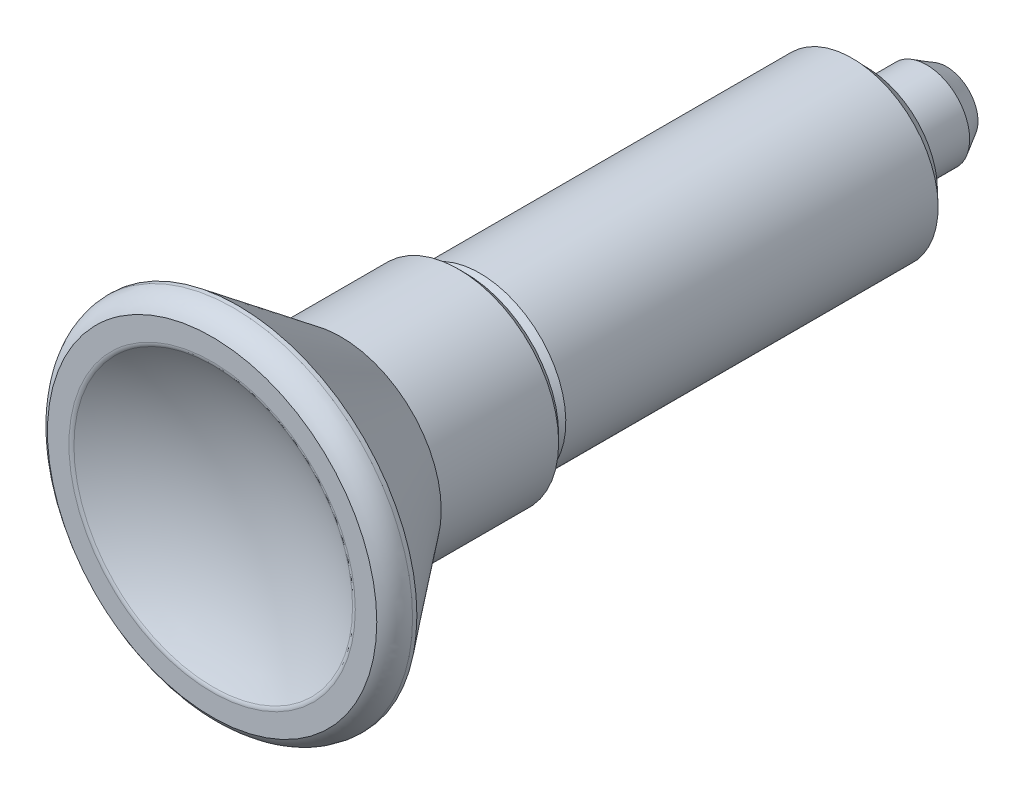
ISO-10303-21;
HEADER;
FILE_DESCRIPTION(('STEP AP214'),'2;1');
FILE_NAME('part.step','',(''),(''),'','','');
FILE_SCHEMA(('AUTOMOTIVE_DESIGN { 1 0 10303 214 1 1 1 1 }'));
ENDSEC;
DATA;
#1=APPLICATION_CONTEXT('core data for automotive mechanical design processes');
#2=APPLICATION_PROTOCOL_DEFINITION('international standard','automotive_design',2000,#1);
#3=PRODUCT_CONTEXT('',#1,'mechanical');
#4=PRODUCT('Part','Part','',(#3));
#5=PRODUCT_RELATED_PRODUCT_CATEGORY('part','',(#4));
#6=PRODUCT_DEFINITION_FORMATION('','',#4);
#7=PRODUCT_DEFINITION_CONTEXT('part definition',#1,'design');
#8=PRODUCT_DEFINITION('design','',#6,#7);
#9=PRODUCT_DEFINITION_SHAPE('','',#8);
#10=(LENGTH_UNIT() NAMED_UNIT(*) SI_UNIT(.MILLI.,.METRE.));
#11=(NAMED_UNIT(*) PLANE_ANGLE_UNIT() SI_UNIT($,.RADIAN.));
#12=(NAMED_UNIT(*) SI_UNIT($,.STERADIAN.) SOLID_ANGLE_UNIT());
#13=UNCERTAINTY_MEASURE_WITH_UNIT(LENGTH_MEASURE(1.E-05),#10,'distance_accuracy_value','');
#14=(GEOMETRIC_REPRESENTATION_CONTEXT(3) GLOBAL_UNCERTAINTY_ASSIGNED_CONTEXT((#13)) GLOBAL_UNIT_ASSIGNED_CONTEXT((#10,
#11,#12)) REPRESENTATION_CONTEXT('',''));
#15=CARTESIAN_POINT('',(0.,0.,0.));
#16=DIRECTION('',(0.,0.,1.));
#17=DIRECTION('',(1.,0.,0.));
#18=AXIS2_PLACEMENT_3D('',#15,#16,#17);
#19=CARTESIAN_POINT('',(0.,0.,2.4980018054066E-13));
#20=DIRECTION('',(0.,0.,1.));
#21=DIRECTION('',(-0.383049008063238,0.923728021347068,0.));
#22=AXIS2_PLACEMENT_3D('',#19,#20,#21);
#23=SPHERICAL_SURFACE('',#22,5.9999999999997);
#24=CARTESIAN_POINT('',(0.,0.,-5.58107460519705));
#25=DIRECTION('',(0.,0.,1.));
#26=DIRECTION('',(0.923728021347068,0.383049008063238,0.));
#27=AXIS2_PLACEMENT_3D('',#24,#25,#26);
#28=CIRCLE('',#27,2.20263620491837);
#29=CARTESIAN_POINT('',(2.03463678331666,0.843717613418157,-5.58107460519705));
#30=VERTEX_POINT('',#29);
#31=EDGE_CURVE('E37',#30,#30,#28,.T.);
#32=ORIENTED_EDGE('',*,*,#31,.F.);
#33=EDGE_LOOP('',(#32));
#34=FACE_BOUND('',#33,.T.);
#35=ADVANCED_FACE('F12',(#34),#23,.T.);
#36=CARTESIAN_POINT('',(0.,0.,-4.19999999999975));
#37=DIRECTION('',(0.,0.,1.));
#38=DIRECTION('',(0.923728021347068,0.383049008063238,0.));
#39=AXIS2_PLACEMENT_3D('',#36,#37,#38);
#40=CONICAL_SURFACE('',#39,3.,0.523598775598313);
#41=ORIENTED_EDGE('',*,*,#31,.T.);
#42=EDGE_LOOP('',(#41));
#43=FACE_BOUND('',#42,.T.);
#44=CARTESIAN_POINT('',(0.,0.,-4.19999999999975));
#45=DIRECTION('',(0.,0.,1.));
#46=DIRECTION('',(0.923728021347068,0.383049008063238,0.));
#47=AXIS2_PLACEMENT_3D('',#44,#45,#46);
#48=CIRCLE('',#47,3.);
#49=CARTESIAN_POINT('',(2.7711840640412,1.14914702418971,-4.19999999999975));
#50=VERTEX_POINT('',#49);
#51=EDGE_CURVE('E34',#50,#50,#48,.T.);
#52=ORIENTED_EDGE('',*,*,#51,.F.);
#53=EDGE_LOOP('',(#52));
#54=FACE_BOUND('',#53,.T.);
#55=ADVANCED_FACE('F134',(#43,#54),#40,.T.);
#56=CARTESIAN_POINT('',(0.,0.,36.0000000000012));
#57=DIRECTION('',(0.,0.,1.));
#58=DIRECTION('',(0.923728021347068,0.383049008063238,0.));
#59=AXIS2_PLACEMENT_3D('',#56,#57,#58);
#60=CYLINDRICAL_SURFACE('',#59,3.);
#61=ORIENTED_EDGE('',*,*,#51,.T.);
#62=EDGE_LOOP('',(#61));
#63=FACE_BOUND('',#62,.T.);
#64=CARTESIAN_POINT('',(0.,0.,0.));
#65=DIRECTION('',(0.,0.,1.));
#66=DIRECTION('',(0.923728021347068,0.383049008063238,0.));
#67=AXIS2_PLACEMENT_3D('',#64,#65,#66);
#68=CIRCLE('',#67,3.);
#69=CARTESIAN_POINT('',(2.7711840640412,1.14914702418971,0.));
#70=VERTEX_POINT('',#69);
#71=EDGE_CURVE('E31',#70,#70,#68,.T.);
#72=ORIENTED_EDGE('',*,*,#71,.F.);
#73=EDGE_LOOP('',(#72));
#74=FACE_BOUND('',#73,.T.);
#75=ADVANCED_FACE('F137',(#63,#74),#60,.T.);
#76=CARTESIAN_POINT('',(-1.89609258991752,4.57245370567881,0.));
#77=DIRECTION('',(0.,0.,-1.));
#78=DIRECTION('',(-0.923728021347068,-0.383049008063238,0.));
#79=AXIS2_PLACEMENT_3D('',#76,#77,#78);
#80=PLANE('',#79);
#81=ORIENTED_EDGE('',*,*,#71,.T.);
#82=EDGE_LOOP('',(#81));
#83=FACE_BOUND('',#82,.T.);
#84=CARTESIAN_POINT('',(0.,0.,0.));
#85=DIRECTION('',(0.,0.,1.));
#86=DIRECTION('',(0.923728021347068,0.383049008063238,0.));
#87=AXIS2_PLACEMENT_3D('',#84,#85,#86);
#88=CIRCLE('',#87,4.95000000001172);
#89=CARTESIAN_POINT('',(4.57245370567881,1.89609258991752,0.));
#90=VERTEX_POINT('',#89);
#91=EDGE_CURVE('E26',#90,#90,#88,.T.);
#92=ORIENTED_EDGE('',*,*,#91,.F.);
#93=EDGE_LOOP('',(#92));
#94=FACE_BOUND('',#93,.T.);
#95=ADVANCED_FACE('F141',(#83,#94),#80,.T.);
#96=CARTESIAN_POINT('',(0.,0.,0.999999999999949));
#97=DIRECTION('',(0.,0.,1.));
#98=DIRECTION('',(0.923728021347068,0.383049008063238,0.));
#99=AXIS2_PLACEMENT_3D('',#96,#97,#98);
#100=CONICAL_SURFACE('',#99,6.00000000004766,0.809783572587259);
#101=ORIENTED_EDGE('',*,*,#91,.T.);
#102=EDGE_LOOP('',(#101));
#103=FACE_BOUND('',#102,.T.);
#104=CARTESIAN_POINT('',(0.,0.,0.999999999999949));
#105=DIRECTION('',(0.,0.,1.));
#106=DIRECTION('',(0.923728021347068,0.383049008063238,0.));
#107=AXIS2_PLACEMENT_3D('',#104,#105,#106);
#108=CIRCLE('',#107,6.00000000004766);
#109=CARTESIAN_POINT('',(5.54236812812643,2.29829404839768,0.99999999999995));
#110=VERTEX_POINT('',#109);
#111=EDGE_CURVE('E22',#110,#110,#108,.T.);
#112=ORIENTED_EDGE('',*,*,#111,.F.);
#113=EDGE_LOOP('',(#112));
#114=FACE_BOUND('',#113,.T.);
#115=ADVANCED_FACE('F145',(#103,#114),#100,.T.);
#116=CARTESIAN_POINT('',(0.,0.,36.0000000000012));
#117=DIRECTION('',(0.,0.,1.));
#118=DIRECTION('',(0.923728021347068,0.383049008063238,0.));
#119=AXIS2_PLACEMENT_3D('',#116,#117,#118);
#120=CYLINDRICAL_SURFACE('',#119,6.00000000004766);
#121=ORIENTED_EDGE('',*,*,#111,.T.);
#122=EDGE_LOOP('',(#121));
#123=FACE_BOUND('',#122,.T.);
#124=CARTESIAN_POINT('',(0.,0.,27.));
#125=DIRECTION('',(0.,0.,1.));
#126=DIRECTION('',(0.923728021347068,0.383049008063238,0.));
#127=AXIS2_PLACEMENT_3D('',#124,#125,#126);
#128=CIRCLE('',#127,6.00000000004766);
#129=CARTESIAN_POINT('',(5.54236812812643,2.29829404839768,27.));
#130=VERTEX_POINT('',#129);
#131=EDGE_CURVE('E18',#130,#130,#128,.T.);
#132=ORIENTED_EDGE('',*,*,#131,.F.);
#133=EDGE_LOOP('',(#132));
#134=FACE_BOUND('',#133,.T.);
#135=ADVANCED_FACE('F149',(#123,#134),#120,.T.);
#136=CARTESIAN_POINT('',(0.,0.,28.000000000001));
#137=DIRECTION('',(0.,0.,-1.));
#138=DIRECTION('',(-0.923728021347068,-0.383049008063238,0.));
#139=AXIS2_PLACEMENT_3D('',#136,#137,#138);
#140=CONICAL_SURFACE('',#139,5.00000000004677,0.785398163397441);
#141=ORIENTED_EDGE('',*,*,#131,.T.);
#142=EDGE_LOOP('',(#141));
#143=FACE_BOUND('',#142,.T.);
#144=CARTESIAN_POINT('',(0.,0.,28.000000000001));
#145=DIRECTION('',(0.,0.,1.));
#146=DIRECTION('',(0.923728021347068,0.383049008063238,0.));
#147=AXIS2_PLACEMENT_3D('',#144,#145,#146);
#148=CIRCLE('',#147,5.00000000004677);
#149=CARTESIAN_POINT('',(4.61864010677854,1.91524504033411,28.000000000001));
#150=VERTEX_POINT('',#149);
#151=EDGE_CURVE('E8',#150,#150,#148,.T.);
#152=ORIENTED_EDGE('',*,*,#151,.F.);
#153=EDGE_LOOP('',(#152));
#154=FACE_BOUND('',#153,.T.);
#155=ADVANCED_FACE('F132',(#143,#154),#140,.T.);
#156=CARTESIAN_POINT('',(-4.22152478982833E-13,0.,60.7643824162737));
#157=DIRECTION('',(0.,0.,-1.));
#158=DIRECTION('',(1.,0.,0.));
#159=AXIS2_PLACEMENT_3D('',#156,#157,#158);
#160=SPHERICAL_SURFACE('',#159,17.9999999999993);
#161=CARTESIAN_POINT('',(0.,0.,45.6206589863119));
#162=DIRECTION('',(0.,0.,-1.));
#163=DIRECTION('',(1.,0.,0.));
#164=AXIS2_PLACEMENT_3D('',#161,#162,#163);
#165=CIRCLE('',#164,9.72972973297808);
#166=CARTESIAN_POINT('',(9.72972973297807,0.,45.6206589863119));
#167=VERTEX_POINT('',#166);
#168=EDGE_CURVE('E41',#167,#167,#165,.T.);
#169=ORIENTED_EDGE('',*,*,#168,.F.);
#170=EDGE_LOOP('',(#169));
#171=FACE_BOUND('',#170,.T.);
#172=ADVANCED_FACE('F123',(#171),#160,.F.);
#173=CARTESIAN_POINT('',(9.72972973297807,0.,45.6206589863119));
#174=CARTESIAN_POINT('',(9.85321912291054,0.,45.7000000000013));
#175=CARTESIAN_POINT('',(10.,0.,45.7000000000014));
#176=CARTESIAN_POINT('',(9.72972973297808,-16.8523862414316,45.620658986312));
#177=CARTESIAN_POINT('',(9.85321912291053,-17.0662761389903,45.7000000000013));
#178=CARTESIAN_POINT('',(10.,-17.3205080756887,45.7000000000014));
#179=CARTESIAN_POINT('',(-4.86486486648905,-8.4261931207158,45.6206589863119));
#180=CARTESIAN_POINT('',(-4.92660956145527,-8.53313806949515,45.7000000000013));
#181=CARTESIAN_POINT('',(-5.,-8.66025403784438,45.7000000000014));
#182=CARTESIAN_POINT('',(-19.4594594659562,0.,45.620658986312));
#183=CARTESIAN_POINT('',(-19.7064382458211,0.,45.7000000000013));
#184=CARTESIAN_POINT('',(-20.,0.,45.7000000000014));
#185=CARTESIAN_POINT('',(-4.86486486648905,8.4261931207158,45.6206589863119));
#186=CARTESIAN_POINT('',(-4.92660956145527,8.53313806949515,45.7000000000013));
#187=CARTESIAN_POINT('',(-5.,8.66025403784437,45.7000000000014));
#188=CARTESIAN_POINT('',(9.72972973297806,16.8523862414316,45.620658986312));
#189=CARTESIAN_POINT('',(9.85321912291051,17.0662761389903,45.7000000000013));
#190=CARTESIAN_POINT('',(10.,17.3205080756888,45.7000000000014));
#191=CARTESIAN_POINT('',(9.72972973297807,0.,45.6206589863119));
#192=CARTESIAN_POINT('',(9.85321912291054,0.,45.7000000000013));
#193=CARTESIAN_POINT('',(10.,0.,45.7000000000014));
#194=(BOUNDED_SURFACE() B_SPLINE_SURFACE(2,2,((#173,#174,#175),(#176,#177,#178),(#179,#180,
#181),(#182,#183,#184),(#185,#186,#187),(#188,#189,#190),(#191,#192,#193)),.UNSPECIFIED.,.T.,
.F.,.F.) B_SPLINE_SURFACE_WITH_KNOTS((3,2,2,3),(3,3),(0.,116.340564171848,232.681128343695,
349.021692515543),(0.,1.),
.UNSPECIFIED.) GEOMETRIC_REPRESENTATION_ITEM() RATIONAL_B_SPLINE_SURFACE(((1.,0.959509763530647,
1.),(0.5,0.479754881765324,0.5),(1.,0.959509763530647,1.),(0.5,0.479754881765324,0.5),(1.,
0.959509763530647,1.),(0.5,0.479754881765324,0.5),(1.,0.959509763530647,1.))) REPRESENTATION_ITEM('') SURFACE());
#195=CARTESIAN_POINT('',(0.,0.,45.7000000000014));
#196=DIRECTION('',(0.,0.,-1.));
#197=DIRECTION('',(1.,0.,0.));
#198=AXIS2_PLACEMENT_3D('',#195,#196,#197);
#199=CIRCLE('',#198,10.);
#200=CARTESIAN_POINT('',(10.,0.,45.7000000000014));
#201=VERTEX_POINT('',#200);
#202=EDGE_CURVE('E45',#201,#201,#199,.T.);
#203=CARTESIAN_POINT('',(9.72972973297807,0.,45.6206589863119));
#204=CARTESIAN_POINT('',(9.73220132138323,0.,45.6222469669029));
#205=CARTESIAN_POINT('',(9.73468690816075,0.,45.6238131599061));
#206=CARTESIAN_POINT('',(9.7396912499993,0.,45.6269051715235));
#207=CARTESIAN_POINT('',(9.7422100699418,0.,45.6284308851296));
#208=CARTESIAN_POINT('',(9.74727991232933,0.,45.631440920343));
#209=CARTESIAN_POINT('',(9.74983099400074,0.,45.6329251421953));
#210=CARTESIAN_POINT('',(9.75496435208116,0.,45.6358512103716));
#211=CARTESIAN_POINT('',(9.75754668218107,0.,45.6372929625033));
#212=CARTESIAN_POINT('',(9.7627414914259,0.,45.6401331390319));
#213=CARTESIAN_POINT('',(9.76535401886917,0.,45.6415314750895));
#214=CARTESIAN_POINT('',(9.77060813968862,0.,45.6442839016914));
#215=CARTESIAN_POINT('',(9.77324977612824,0.,45.6456379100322));
#216=CARTESIAN_POINT('',(9.77856099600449,0.,45.6483007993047));
#217=CARTESIAN_POINT('',(9.78123061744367,0.,45.6496096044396));
#218=CARTESIAN_POINT('',(9.78659665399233,0.,45.6521812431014));
#219=CARTESIAN_POINT('',(9.78929310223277,0.,45.6534440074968));
#220=CARTESIAN_POINT('',(9.79471160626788,0.,45.6559227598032));
#221=CARTESIAN_POINT('',(9.79743369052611,0.,45.6571386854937));
#222=CARTESIAN_POINT('',(9.80290224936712,0.,45.6595229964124));
#223=CARTESIAN_POINT('',(9.80564874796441,0.,45.6606913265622));
#224=CARTESIAN_POINT('',(9.81116488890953,0.,45.6629797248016));
#225=CARTESIAN_POINT('',(9.81393455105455,0.,45.6640997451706));
#226=CARTESIAN_POINT('',(9.81949574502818,0.,45.6662908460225));
#227=CARTESIAN_POINT('',(9.82228729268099,0.,45.6673618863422));
#228=CARTESIAN_POINT('',(9.82789095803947,0.,45.6694543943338));
#229=CARTESIAN_POINT('',(9.83070308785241,0.,45.6704758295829));
#230=CARTESIAN_POINT('',(9.83634659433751,0.,45.6724685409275));
#231=CARTESIAN_POINT('',(9.83917797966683,0.,45.6734397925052));
#232=CARTESIAN_POINT('',(9.84485865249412,0.,45.6753315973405));
#233=CARTESIAN_POINT('',(9.84770794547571,0.,45.6762521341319));
#234=CARTESIAN_POINT('',(9.85342306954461,0.,45.6780420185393));
#235=CARTESIAN_POINT('',(9.85628890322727,0.,45.6789113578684));
#236=CARTESIAN_POINT('',(9.86203572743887,0.,45.6805984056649));
#237=CARTESIAN_POINT('',(9.86491671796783,0.,45.6814161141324));
#238=CARTESIAN_POINT('',(9.87069245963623,0.,45.6829995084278));
#239=CARTESIAN_POINT('',(9.87358720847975,0.,45.6837652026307));
#240=CARTESIAN_POINT('',(9.87938905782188,0.,45.6852442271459));
#241=CARTESIAN_POINT('',(9.88229615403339,0.,45.6859575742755));
#242=CARTESIAN_POINT('',(9.88812127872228,0.,45.6873316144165));
#243=CARTESIAN_POINT('',(9.89103930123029,0.,45.6879923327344));
#244=CARTESIAN_POINT('',(9.89688485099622,0.,45.6892608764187));
#245=CARTESIAN_POINT('',(9.89981237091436,0.,45.6898687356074));
#246=CARTESIAN_POINT('',(9.90567548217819,0.,45.6910313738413));
#247=CARTESIAN_POINT('',(9.90861106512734,0.,45.6915861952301));
#248=CARTESIAN_POINT('',(9.91448886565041,0.,45.6926426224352));
#249=CARTESIAN_POINT('',(9.91743107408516,0.,45.6931442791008));
#250=CARTESIAN_POINT('',(9.92332068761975,0.,45.6940942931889));
#251=CARTESIAN_POINT('',(9.92626808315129,0.,45.6945427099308));
#252=CARTESIAN_POINT('',(9.93216663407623,0.,45.6953862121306));
#253=CARTESIAN_POINT('',(9.93511777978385,0.,45.6957813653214));
#254=CARTESIAN_POINT('',(9.94102239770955,0.,45.6965183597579));
#255=CARTESIAN_POINT('',(9.94397586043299,0.,45.6968602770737));
#256=CARTESIAN_POINT('',(9.94988368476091,0.,45.697490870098));
#257=CARTESIAN_POINT('',(9.95283803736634,0.,45.6977796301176));
#258=CARTESIAN_POINT('',(9.95874622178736,0.,45.6983040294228));
#259=CARTESIAN_POINT('',(9.96170004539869,0.,45.6985397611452));
#260=CARTESIAN_POINT('',(9.96760576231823,0.,45.6989582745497));
#261=CARTESIAN_POINT('',(9.97055764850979,0.,45.6991411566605));
#262=CARTESIAN_POINT('',(9.97645809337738,0.,45.6994541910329));
#263=CARTESIAN_POINT('',(9.97940664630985,0.,45.6995844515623));
#264=CARTESIAN_POINT('',(9.98529904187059,0.,45.6997925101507));
#265=CARTESIAN_POINT('',(9.98824288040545,0.,45.6998704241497));
#266=CARTESIAN_POINT('',(9.99412448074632,0.,45.6999741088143));
#267=CARTESIAN_POINT('',(9.99706224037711,0.,45.7000000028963));
#268=CARTESIAN_POINT('',(10.,0.,45.7000000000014));
#269=B_SPLINE_CURVE_WITH_KNOTS('',3,(#203,#204,#205,#206,#207,#208,#209,#210,#211,#212,#213,
#214,#215,#216,#217,#218,#219,#220,#221,#222,#223,#224,#225,#226,#227,#228,#229,#230,#231,#232,
#233,#234,#235,#236,#237,#238,#239,#240,#241,#242,#243,#244,#245,#246,#247,#248,#249,#250,#251,
#252,#253,#254,#255,#256,#257,#258,#259,#260,#261,#262,#263,#264,#265,#266,#267,#268),
.UNSPECIFIED.,.F.,.F.,(4,2,2,2,2,2,2,2,2,2,2,2,2,2,2,2,2,2,2,2,2,2,2,2,2,2,2,2,2,2,2,2,4),(0.,
0.00881316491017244,0.0176473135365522,0.026501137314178,0.0353733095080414,0.0442624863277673,
0.0531673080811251,0.0620864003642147,0.0710183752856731,0.0799618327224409,0.0889153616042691,
0.0978775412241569,0.106846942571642,0.115822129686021,0.124801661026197,0.133784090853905,
0.142767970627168,0.151751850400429,0.160734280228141,0.169713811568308,0.178688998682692,
0.187658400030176,0.196620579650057,0.20557410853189,0.214517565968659,0.223449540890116,
0.232368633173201,0.241273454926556,0.250162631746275,0.259034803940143,0.267888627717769,
0.276722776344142,0.285535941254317),.UNSPECIFIED.);
#270=EDGE_CURVE('BSEAM117',#167,#201,#269,.T.);
#271=ORIENTED_EDGE('',*,*,#168,.T.);
#272=ORIENTED_EDGE('',*,*,#202,.F.);
#273=ORIENTED_EDGE('',*,*,#270,.T.);
#274=ORIENTED_EDGE('',*,*,#270,.F.);
#275=EDGE_LOOP('',(#271,#273,#272,#274));
#276=FACE_BOUND('',#275,.T.);
#277=ADVANCED_FACE('F117',(#276),#194,.T.);
#278=CARTESIAN_POINT('',(-12.65,-12.65,45.7000000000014));
#279=DIRECTION('',(0.,0.,1.));
#280=DIRECTION('',(1.,0.,0.));
#281=AXIS2_PLACEMENT_3D('',#278,#279,#280);
#282=PLANE('',#281);
#283=CARTESIAN_POINT('',(0.,0.,45.7000000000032));
#284=DIRECTION('',(0.,0.,-1.));
#285=DIRECTION('',(1.,0.,0.));
#286=AXIS2_PLACEMENT_3D('',#283,#284,#285);
#287=CIRCLE('',#286,11.4999999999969);
#288=CARTESIAN_POINT('',(11.4999999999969,0.,45.7000000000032));
#289=VERTEX_POINT('',#288);
#290=EDGE_CURVE('E49',#289,#289,#287,.T.);
#291=ORIENTED_EDGE('',*,*,#290,.F.);
#292=EDGE_LOOP('',(#291));
#293=FACE_BOUND('',#292,.T.);
#294=ORIENTED_EDGE('',*,*,#202,.T.);
#295=EDGE_LOOP('',(#294));
#296=FACE_BOUND('',#295,.T.);
#297=ADVANCED_FACE('F108',(#293,#296),#282,.T.);
#298=CARTESIAN_POINT('',(11.4999999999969,0.,45.7000000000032));
#299=CARTESIAN_POINT('',(12.3786586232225,0.,45.2024390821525));
#300=CARTESIAN_POINT('',(12.5,0.,44.200000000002));
#301=CARTESIAN_POINT('',(11.4999999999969,-19.9185842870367,45.7000000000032));
#302=CARTESIAN_POINT('',(12.3786586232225,-21.440465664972,45.2024390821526));
#303=CARTESIAN_POINT('',(12.5,-21.6506350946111,44.200000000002));
#304=CARTESIAN_POINT('',(-5.74999999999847,-9.95929214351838,45.7000000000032));
#305=CARTESIAN_POINT('',(-6.18932931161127,-10.720232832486,45.2024390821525));
#306=CARTESIAN_POINT('',(-6.25,-10.8253175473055,44.200000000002));
#307=CARTESIAN_POINT('',(-22.9999999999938,0.,45.7000000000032));
#308=CARTESIAN_POINT('',(-24.7573172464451,0.,45.2024390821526));
#309=CARTESIAN_POINT('',(-25.,0.,44.200000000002));
#310=CARTESIAN_POINT('',(-5.74999999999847,9.95929214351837,45.7000000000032));
#311=CARTESIAN_POINT('',(-6.18932931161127,10.720232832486,45.2024390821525));
#312=CARTESIAN_POINT('',(-6.25,10.8253175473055,44.200000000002));
#313=CARTESIAN_POINT('',(11.4999999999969,19.9185842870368,45.7000000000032));
#314=CARTESIAN_POINT('',(12.3786586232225,21.440465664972,45.2024390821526));
#315=CARTESIAN_POINT('',(12.5,21.6506350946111,44.200000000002));
#316=CARTESIAN_POINT('',(11.4999999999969,0.,45.7000000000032));
#317=CARTESIAN_POINT('',(12.3786586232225,0.,45.2024390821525));
#318=CARTESIAN_POINT('',(12.5,0.,44.200000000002));
#319=(BOUNDED_SURFACE() B_SPLINE_SURFACE(2,2,((#298,#299,#300),(#301,#302,#303),(#304,#305,
#306),(#307,#308,#309),(#310,#311,#312),(#313,#314,#315),(#316,#317,#318)),.UNSPECIFIED.,.T.,
.F.,.F.) B_SPLINE_SURFACE_WITH_KNOTS((3,2,2,3),(3,3),(0.,20.8901320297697,41.7802640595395,
62.6703960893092),(0.,1.),
.UNSPECIFIED.) GEOMETRIC_REPRESENTATION_ITEM() RATIONAL_B_SPLINE_SURFACE(((1.,0.89267855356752,
1.),(0.5,0.44633927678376,0.5),(1.,0.89267855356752,1.),(0.5,0.44633927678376,0.5),(1.,
0.89267855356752,1.),(0.5,0.44633927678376,0.5),(1.,0.89267855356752,1.))) REPRESENTATION_ITEM('') SURFACE());
#320=CARTESIAN_POINT('',(0.,0.,44.200000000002));
#321=DIRECTION('',(0.,0.,-1.));
#322=DIRECTION('',(1.,0.,0.));
#323=AXIS2_PLACEMENT_3D('',#320,#321,#322);
#324=CIRCLE('',#323,12.5);
#325=CARTESIAN_POINT('',(12.5,0.,44.200000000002));
#326=VERTEX_POINT('',#325);
#327=EDGE_CURVE('E53',#326,#326,#324,.T.);
#328=CARTESIAN_POINT('',(11.4999999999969,0.,45.7000000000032));
#329=CARTESIAN_POINT('',(11.5040886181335,0.,45.6976847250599));
#330=CARTESIAN_POINT('',(11.5081690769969,0.,45.6953550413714));
#331=CARTESIAN_POINT('',(11.516320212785,0.,45.6906630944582));
#332=CARTESIAN_POINT('',(11.5203908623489,0.,45.6883007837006));
#333=CARTESIAN_POINT('',(11.5285220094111,0.,45.6835436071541));
#334=CARTESIAN_POINT('',(11.5325824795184,0.,45.6811486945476));
#335=CARTESIAN_POINT('',(11.5406928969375,0.,45.6763263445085));
#336=CARTESIAN_POINT('',(11.5447428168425,0.,45.673898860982));
#337=CARTESIAN_POINT('',(11.5528317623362,0.,45.6690114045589));
#338=CARTESIAN_POINT('',(11.5568707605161,0.,45.6665513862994));
#339=CARTESIAN_POINT('',(11.5649374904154,0.,45.6615989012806));
#340=CARTESIAN_POINT('',(11.5689651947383,0.,45.6591063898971));
#341=CARTESIAN_POINT('',(11.577008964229,0.,45.6540889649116));
#342=CARTESIAN_POINT('',(11.581025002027,0.,45.6515640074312));
#343=CARTESIAN_POINT('',(11.5890450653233,0.,45.6464817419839));
#344=CARTESIAN_POINT('',(11.5930490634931,0.,45.6439243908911));
#345=CARTESIAN_POINT('',(11.6010446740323,0.,45.638777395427));
#346=CARTESIAN_POINT('',(11.605036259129,0.,45.6361877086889));
#347=CARTESIAN_POINT('',(11.6130066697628,0.,45.630976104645));
#348=CARTESIAN_POINT('',(11.6169854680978,0.,45.6283541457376));
#349=CARTESIAN_POINT('',(11.6249299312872,0.,45.6230780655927));
#350=CARTESIAN_POINT('',(11.6288955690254,0.,45.6204239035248));
#351=CARTESIAN_POINT('',(11.6368133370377,0.,45.6150834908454));
#352=CARTESIAN_POINT('',(11.6407654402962,0.,45.6123972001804));
#353=CARTESIAN_POINT('',(11.6486557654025,0.,45.6069926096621));
#354=CARTESIAN_POINT('',(11.6525939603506,0.,45.6042742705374));
#355=CARTESIAN_POINT('',(11.6604560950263,0.,45.5988056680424));
#356=CARTESIAN_POINT('',(11.6643800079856,0.,45.5960553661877));
#357=CARTESIAN_POINT('',(11.6722132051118,0.,45.5905229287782));
#358=CARTESIAN_POINT('',(11.6761224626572,0.,45.5877407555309));
#359=CARTESIAN_POINT('',(11.6839259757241,0.,45.5821446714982));
#360=CARTESIAN_POINT('',(11.6878202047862,0.,45.5793307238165));
#361=CARTESIAN_POINT('',(11.6955932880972,0.,45.5736711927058));
#362=CARTESIAN_POINT('',(11.6994721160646,0.,45.5708255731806));
#363=CARTESIAN_POINT('',(11.7072140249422,0.,45.5651028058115));
#364=CARTESIAN_POINT('',(11.7110770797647,0.,45.5622256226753));
#365=CARTESIAN_POINT('',(11.718787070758,0.,45.5564398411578));
#366=CARTESIAN_POINT('',(11.7226339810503,0.,45.5535312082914));
#367=CARTESIAN_POINT('',(11.7303113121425,0.,45.5476826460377));
#368=CARTESIAN_POINT('',(11.734141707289,0.,45.5447426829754));
#369=CARTESIAN_POINT('',(11.7417856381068,0.,45.5388315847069));
#370=CARTESIAN_POINT('',(11.7455991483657,0.,45.5358604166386));
#371=CARTESIAN_POINT('',(11.7532089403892,0.,45.5298870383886));
#372=CARTESIAN_POINT('',(11.7570051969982,0.,45.5268847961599));
#373=CARTESIAN_POINT('',(11.7645801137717,0.,45.5208494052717));
#374=CARTESIAN_POINT('',(11.7683587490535,0.,45.5178162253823));
#375=CARTESIAN_POINT('',(11.7758980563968,0.,45.5117191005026));
#376=CARTESIAN_POINT('',(11.7796587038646,0.,45.5086551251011));
#377=CARTESIAN_POINT('',(11.7871616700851,0.,45.5024965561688));
#378=CARTESIAN_POINT('',(11.7909039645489,0.,45.4994019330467));
#379=CARTESIAN_POINT('',(11.7983698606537,0.,45.4931822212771));
#380=CARTESIAN_POINT('',(11.8020934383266,0.,45.4900571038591));
#381=CARTESIAN_POINT('',(11.8095215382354,0.,45.4837765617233));
#382=CARTESIAN_POINT('',(11.81322603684,0.,45.4806211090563));
#383=CARTESIAN_POINT('',(11.8206156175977,0.,45.4742800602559));
#384=CARTESIAN_POINT('',(11.8243006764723,0.,45.4710944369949));
#385=CARTESIAN_POINT('',(11.8316510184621,0.,45.4646932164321));
#386=CARTESIAN_POINT('',(11.8353162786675,0.,45.4614775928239));
#387=CARTESIAN_POINT('',(11.8426266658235,0.,45.4550165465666));
#388=CARTESIAN_POINT('',(11.8462717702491,0.,45.4517710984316));
#389=CARTESIAN_POINT('',(11.8535414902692,0.,45.445250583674));
#390=CARTESIAN_POINT('',(11.8571660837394,0.,45.4419754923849));
#391=CARTESIAN_POINT('',(11.8643944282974,0.,45.4353958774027));
#392=CARTESIAN_POINT('',(11.8679981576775,0.,45.4320913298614));
#393=CARTESIAN_POINT('',(11.8751844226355,0.,45.4254529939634));
#394=CARTESIAN_POINT('',(11.8787669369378,0.,45.4221191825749));
#395=CARTESIAN_POINT('',(11.8859104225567,0.,45.4154225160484));
#396=CARTESIAN_POINT('',(11.8894713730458,0.,45.4120596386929));
#397=CARTESIAN_POINT('',(11.896571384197,0.,45.4053050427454));
#398=CARTESIAN_POINT('',(11.9001104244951,0.,45.4019133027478));
#399=CARTESIAN_POINT('',(11.9071662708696,0.,45.3951011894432));
#400=CARTESIAN_POINT('',(11.9106830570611,0.,45.3916807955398));
#401=CARTESIAN_POINT('',(11.9176940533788,0.,45.3848115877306));
#402=CARTESIAN_POINT('',(11.9211882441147,0.,45.3813627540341));
#403=CARTESIAN_POINT('',(11.9281537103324,0.,45.3744368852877));
#404=CARTESIAN_POINT('',(11.9316249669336,0.,45.3709598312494));
#405=CARTESIAN_POINT('',(11.9385442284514,0.,45.3639777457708));
#406=CARTESIAN_POINT('',(11.9419922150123,0.,45.3604726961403));
#407=CARTESIAN_POINT('',(11.9488646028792,0.,45.3534348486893));
#408=CARTESIAN_POINT('',(11.9522889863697,0.,45.3499020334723));
#409=CARTESIAN_POINT('',(11.9591138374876,0.,45.3428088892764));
#410=CARTESIAN_POINT('',(11.9625142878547,0.,45.33924854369));
#411=CARTESIAN_POINT('',(11.9692909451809,0.,45.3321005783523));
#412=CARTESIAN_POINT('',(11.9726671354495,0.,45.3285129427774));
#413=CARTESIAN_POINT('',(11.9793949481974,0.,45.32131064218));
#414=CARTESIAN_POINT('',(11.9827465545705,0.,45.3176959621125));
#415=CARTESIAN_POINT('',(11.9894248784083,0.,45.3104398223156));
#416=CARTESIAN_POINT('',(11.9927515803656,0.,45.3067983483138));
#417=CARTESIAN_POINT('',(11.9993797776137,0.,45.2994888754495));
#418=CARTESIAN_POINT('',(12.0026812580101,0.,45.295820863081));
#419=CARTESIAN_POINT('',(12.0092586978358,0.,45.2884585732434));
#420=CARTESIAN_POINT('',(12.0125346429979,0.,45.284764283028));
#421=CARTESIAN_POINT('',(12.0190607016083,0.,45.2773497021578));
#422=CARTESIAN_POINT('',(12.0223108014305,0.,45.2736293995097));
#423=CARTESIAN_POINT('',(12.0287848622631,0.,45.2661630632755));
#424=CARTESIAN_POINT('',(12.0320088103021,0.,45.2624170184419));
#425=CARTESIAN_POINT('',(12.0384302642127,0.,45.2548994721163));
#426=CARTESIAN_POINT('',(12.041627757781,0.,45.2511279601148));
#427=CARTESIAN_POINT('',(12.0479960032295,0.,45.2435597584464));
#428=CARTESIAN_POINT('',(12.0511667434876,0.,45.239763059));
#429=CARTESIAN_POINT('',(12.0574811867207,0.,45.2321447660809));
#430=CARTESIAN_POINT('',(12.0606248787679,0.,45.2283231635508));
#431=CARTESIAN_POINT('',(12.0668849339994,0.,45.2206553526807));
#432=CARTESIAN_POINT('',(12.070001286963,0.,45.2168091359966));
#433=CARTESIAN_POINT('',(12.0762063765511,0.,45.2090923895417));
#434=CARTESIAN_POINT('',(12.0792951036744,0.,45.205221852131));
#435=CARTESIAN_POINT('',(12.0854446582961,0.,45.1974567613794));
#436=CARTESIAN_POINT('',(12.0885054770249,0.,45.1935622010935));
#437=CARTESIAN_POINT('',(12.094598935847,0.,45.1857493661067));
#438=CARTESIAN_POINT('',(12.0976315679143,0.,45.181831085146));
#439=CARTESIAN_POINT('',(12.1036683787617,0.,45.1739711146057));
#440=CARTESIAN_POINT('',(12.106672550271,0.,45.1700294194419));
#441=CARTESIAN_POINT('',(12.1126521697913,0.,45.1621229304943));
#442=CARTESIAN_POINT('',(12.1156276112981,0.,45.1581581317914));
#443=CARTESIAN_POINT('',(12.1215495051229,0.,45.1502057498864));
#444=CARTESIAN_POINT('',(12.1244959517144,0.,45.1462181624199));
#445=CARTESIAN_POINT('',(12.1303595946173,0.,45.1382205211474));
#446=CARTESIAN_POINT('',(12.1332767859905,0.,45.134210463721));
#447=CARTESIAN_POINT('',(12.1390816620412,0.,45.1261682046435));
#448=CARTESIAN_POINT('',(12.1419693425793,0.,45.1221360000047));
#449=CARTESIAN_POINT('',(12.1477149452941,0.,45.1140497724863));
#450=CARTESIAN_POINT('',(12.1505728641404,0.,45.1099957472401));
#451=CARTESIAN_POINT('',(12.1562586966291,0.,45.1018662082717));
#452=CARTESIAN_POINT('',(12.1590866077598,0.,45.0977906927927));
#453=CARTESIAN_POINT('',(12.1647121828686,0.,45.0896185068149));
#454=CARTESIAN_POINT('',(12.1675098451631,0.,45.0855218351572));
#455=CARTESIAN_POINT('',(12.1730746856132,0.,45.0773076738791));
#456=CARTESIAN_POINT('',(12.1758418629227,0.,45.0731901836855));
#457=CARTESIAN_POINT('',(12.1813455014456,0.,45.0649347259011));
#458=CARTESIAN_POINT('',(12.1840819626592,0.,45.0607967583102));
#459=CARTESIAN_POINT('',(12.1895239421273,0.,45.0525006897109));
#460=CARTESIAN_POINT('',(12.1922294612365,0.,45.048342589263));
#461=CARTESIAN_POINT('',(12.1976093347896,0.,45.0400066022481));
#462=CARTESIAN_POINT('',(12.2002836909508,0.,45.0358287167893));
#463=CARTESIAN_POINT('',(12.2056010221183,0.,45.0274535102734));
#464=CARTESIAN_POINT('',(12.2082439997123,0.,45.0232561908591));
#465=CARTESIAN_POINT('',(12.2134983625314,0.,45.0148424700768));
#466=CARTESIAN_POINT('',(12.2161097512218,0.,45.0106260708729));
#467=CARTESIAN_POINT('',(12.2213007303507,0.,45.0021745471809));
#468=CARTESIAN_POINT('',(12.2238803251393,0.,44.9979394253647));
#469=CARTESIAN_POINT('',(12.2290075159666,0.,44.9894508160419));
#470=CARTESIAN_POINT('',(12.2315551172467,0.,44.9851973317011));
#471=CARTESIAN_POINT('',(12.2366181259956,0.,44.9766723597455));
#472=CARTESIAN_POINT('',(12.2391335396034,0.,44.9724008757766));
#473=CARTESIAN_POINT('',(12.2441319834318,0.,44.9638402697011));
#474=CARTESIAN_POINT('',(12.2466150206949,0.,44.9595511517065));
#475=CARTESIAN_POINT('',(12.2515485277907,0.,44.9509556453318));
#476=CARTESIAN_POINT('',(12.2539990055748,0.,44.9466492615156));
#477=CARTESIAN_POINT('',(12.2588672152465,0.,44.9380195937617));
#478=CARTESIAN_POINT('',(12.2612849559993,0.,44.9336963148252));
#479=CARTESIAN_POINT('',(12.2660875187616,0.,44.9250332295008));
#480=CARTESIAN_POINT('',(12.2684723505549,0.,44.9206934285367));
#481=CARTESIAN_POINT('',(12.2732089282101,0.,44.9119976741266));
#482=CARTESIAN_POINT('',(12.2755606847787,0.,44.9076417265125));
#483=CARTESIAN_POINT('',(12.2802309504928,0.,44.8989140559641));
#484=CARTESIAN_POINT('',(12.2825494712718,0.,44.8945423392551));
#485=CARTESIAN_POINT('',(12.2871531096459,0.,44.8857835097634));
#486=CARTESIAN_POINT('',(12.2894382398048,0.,44.8813964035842));
#487=CARTESIAN_POINT('',(12.2939749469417,0.,44.8726071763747));
#488=CARTESIAN_POINT('',(12.2962265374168,0.,44.8682050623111));
#489=CARTESIAN_POINT('',(12.3006960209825,0.,44.8593862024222));
#490=CARTESIAN_POINT('',(12.3029139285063,0.,44.8549694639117));
#491=CARTESIAN_POINT('',(12.3073159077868,0.,44.8461217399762));
#492=CARTESIAN_POINT('',(12.309499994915,0.,44.8416907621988));
#493=CARTESIAN_POINT('',(12.3138342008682,0.,44.8328149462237));
#494=CARTESIAN_POINT('',(12.3159843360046,0.,44.8283701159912));
#495=CARTESIAN_POINT('',(12.3202505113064,0.,44.8194669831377));
#496=CARTESIAN_POINT('',(12.3223665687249,0.,44.8150086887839));
#497=CARTESIAN_POINT('',(12.3265644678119,0.,44.8060790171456));
#498=CARTESIAN_POINT('',(12.3286463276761,0.,44.801607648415));
#499=CARTESIAN_POINT('',(12.3327757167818,0.,44.7926522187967));
#500=CARTESIAN_POINT('',(12.3348232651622,0.,44.788168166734));
#501=CARTESIAN_POINT('',(12.3388839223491,0.,44.7791877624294));
#502=CARTESIAN_POINT('',(12.340897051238,0.,44.774691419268));
#503=CARTESIAN_POINT('',(12.3448887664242,0.,44.765686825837));
#504=CARTESIAN_POINT('',(12.3468673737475,0.,44.761178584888));
#505=CARTESIAN_POINT('',(12.3507899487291,0.,44.7521505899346));
#506=CARTESIAN_POINT('',(12.3527339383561,0.,44.7476308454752));
#507=CARTESIAN_POINT('',(12.3565871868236,0.,44.7385802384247));
#508=CARTESIAN_POINT('',(12.3584964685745,0.,44.7340493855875));
#509=CARTESIAN_POINT('',(12.3622802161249,0.,44.724976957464));
#510=CARTESIAN_POINT('',(12.3641547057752,0.,44.720435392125));
#511=CARTESIAN_POINT('',(12.3678687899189,0.,44.7113419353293));
#512=CARTESIAN_POINT('',(12.3697084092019,0.,44.7067900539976));
#513=CARTESIAN_POINT('',(12.3733526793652,0.,44.6976763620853));
#514=CARTESIAN_POINT('',(12.3751573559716,0.,44.6931145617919));
#515=CARTESIAN_POINT('',(12.3787316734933,0.,44.6839814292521));
#516=CARTESIAN_POINT('',(12.3805013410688,0.,44.6794101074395));
#517=CARTESIAN_POINT('',(12.384005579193,0.,44.6702583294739));
#518=CARTESIAN_POINT('',(12.385740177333,0.,44.6656778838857));
#519=CARTESIAN_POINT('',(12.3891742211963,0.,44.6565082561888));
#520=CARTESIAN_POINT('',(12.3908736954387,0.,44.6519190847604));
#521=CARTESIAN_POINT('',(12.3942374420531,0.,44.6427324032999));
#522=CARTESIAN_POINT('',(12.3959017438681,0.,44.6381349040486));
#523=CARTESIAN_POINT('',(12.3991951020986,0.,44.628931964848));
#524=CARTESIAN_POINT('',(12.4008241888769,0.,44.6243265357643));
#525=CARTESIAN_POINT('',(12.4040470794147,0.,44.6151081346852));
#526=CARTESIAN_POINT('',(12.4056409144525,0.,44.610495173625));
#527=CARTESIAN_POINT('',(12.4087932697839,0.,44.6012621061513));
#528=CARTESIAN_POINT('',(12.4103518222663,0.,44.5966420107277));
#529=CARTESIAN_POINT('',(12.4134335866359,0.,44.5873950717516));
#530=CARTESIAN_POINT('',(12.4149568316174,0.,44.5827682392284));
#531=CARTESIAN_POINT('',(12.4179679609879,0.,44.5735082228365));
#532=CARTESIAN_POINT('',(12.4194558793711,0.,44.5688750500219));
#533=CARTESIAN_POINT('',(12.4223963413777,0.,44.5596027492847));
#534=CARTESIAN_POINT('',(12.4238489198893,0.,44.5549636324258));
#535=CARTESIAN_POINT('',(12.4267186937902,0.,44.5456798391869));
#536=CARTESIAN_POINT('',(12.4281359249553,0.,44.5410351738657));
#537=CARTESIAN_POINT('',(12.4309350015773,0.,44.5317406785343));
#538=CARTESIAN_POINT('',(12.432316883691,0.,44.5270908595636));
#539=CARTESIAN_POINT('',(12.435045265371,0.,44.5177864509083));
#540=CARTESIAN_POINT('',(12.4363918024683,0.,44.5131318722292));
#541=CARTESIAN_POINT('',(12.4390495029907,0.,44.5038183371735));
#542=CARTESIAN_POINT('',(12.4403607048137,0.,44.4991593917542));
#543=CARTESIAN_POINT('',(12.4429477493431,0.,44.4898375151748));
#544=CARTESIAN_POINT('',(12.4442236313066,0.,44.4851745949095));
#545=CARTESIAN_POINT('',(12.4467400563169,0.,44.475845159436));
#546=CARTESIAN_POINT('',(12.4479806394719,0.,44.4711786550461));
#547=CARTESIAN_POINT('',(12.4504264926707,0.,44.4618424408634));
#548=CARTESIAN_POINT('',(12.4516318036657,0.,44.4571727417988));
#549=CARTESIAN_POINT('',(12.4540071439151,0.,44.4478305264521));
#550=CARTESIAN_POINT('',(12.4551772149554,0.,44.4431580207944));
#551=CARTESIAN_POINT('',(12.4574821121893,0.,44.4338105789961));
#552=CARTESIAN_POINT('',(12.4586169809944,0.,44.4291356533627));
#553=CARTESIAN_POINT('',(12.4608515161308,0.,44.4197837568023));
#554=CARTESIAN_POINT('',(12.46195122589,0.,44.415106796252));
#555=CARTESIAN_POINT('',(12.4641154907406,0.,44.4057512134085));
#556=CARTESIAN_POINT('',(12.4651800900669,0.,44.4010726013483));
#557=CARTESIAN_POINT('',(12.4672741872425,0.,44.3917140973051));
#558=CARTESIAN_POINT('',(12.468303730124,0.,44.3870342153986));
#559=CARTESIAN_POINT('',(12.4703277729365,0.,44.3776735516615));
#560=CARTESIAN_POINT('',(12.4713223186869,0.,44.3729927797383));
#561=CARTESIAN_POINT('',(12.4732764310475,0.,44.3636307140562));
#562=CARTESIAN_POINT('',(12.4742360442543,0.,44.3589494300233));
#563=CARTESIAN_POINT('',(12.4761203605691,0.,44.3495867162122));
#564=CARTESIAN_POINT('',(12.4770451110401,0.,44.3449052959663));
#565=CARTESIAN_POINT('',(12.478859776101,0.,44.3355426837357));
#566=CARTESIAN_POINT('',(12.4797497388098,0.,44.3308615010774));
#567=CARTESIAN_POINT('',(12.4814949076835,0.,44.3214997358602));
#568=CARTESIAN_POINT('',(12.4823501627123,0.,44.31681916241));
#569=CARTESIAN_POINT('',(12.4840260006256,0.,44.3074589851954));
#570=CARTESIAN_POINT('',(12.4848466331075,0.,44.3027793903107));
#571=CARTESIAN_POINT('',(12.4864533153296,0.,44.2934215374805));
#572=CARTESIAN_POINT('',(12.4872394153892,0.,44.2887432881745));
#573=CARTESIAN_POINT('',(12.4887771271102,0.,44.2793884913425));
#574=CARTESIAN_POINT('',(12.4895287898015,0.,44.2747119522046));
#575=CARTESIAN_POINT('',(12.4909977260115,0.,44.2653609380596));
#576=CARTESIAN_POINT('',(12.4917150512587,0.,44.2606864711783));
#577=CARTESIAN_POINT('',(12.4931154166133,0.,44.2513399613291));
#578=CARTESIAN_POINT('',(12.4937985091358,0.,44.2466679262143));
#579=CARTESIAN_POINT('',(12.4951305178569,0.,44.2373266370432));
#580=CARTESIAN_POINT('',(12.4957794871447,0.,44.232657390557));
#581=CARTESIAN_POINT('',(12.4970433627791,0.,44.2233220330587));
#582=CARTESIAN_POINT('',(12.4976583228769,0.,44.2186559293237));
#583=CARTESIAN_POINT('',(12.4988542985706,0.,44.2093272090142));
#584=CARTESIAN_POINT('',(12.4994353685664,0.,44.2046645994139));
#585=CARTESIAN_POINT('',(12.5,0.,44.200000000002));
#586=B_SPLINE_CURVE_WITH_KNOTS('',3,(#328,#329,#330,#331,#332,#333,#334,#335,#336,#337,#338,
#339,#340,#341,#342,#343,#344,#345,#346,#347,#348,#349,#350,#351,#352,#353,#354,#355,#356,#357,
#358,#359,#360,#361,#362,#363,#364,#365,#366,#367,#368,#369,#370,#371,#372,#373,#374,#375,#376,
#377,#378,#379,#380,#381,#382,#383,#384,#385,#386,#387,#388,#389,#390,#391,#392,#393,#394,#395,
#396,#397,#398,#399,#400,#401,#402,#403,#404,#405,#406,#407,#408,#409,#410,#411,#412,#413,#414,
#415,#416,#417,#418,#419,#420,#421,#422,#423,#424,#425,#426,#427,#428,#429,#430,#431,#432,#433,
#434,#435,#436,#437,#438,#439,#440,#441,#442,#443,#444,#445,#446,#447,#448,#449,#450,#451,#452,
#453,#454,#455,#456,#457,#458,#459,#460,#461,#462,#463,#464,#465,#466,#467,#468,#469,#470,#471,
#472,#473,#474,#475,#476,#477,#478,#479,#480,#481,#482,#483,#484,#485,#486,#487,#488,#489,#490,
#491,#492,#493,#494,#495,#496,#497,#498,#499,#500,#501,#502,#503,#504,#505,#506,#507,#508,#509,
#510,#511,#512,#513,#514,#515,#516,#517,#518,#519,#520,#521,#522,#523,#524,#525,#526,#527,#528,
#529,#530,#531,#532,#533,#534,#535,#536,#537,#538,#539,#540,#541,#542,#543,#544,#545,#546,#547,
#548,#549,#550,#551,#552,#553,#554,#555,#556,#557,#558,#559,#560,#561,#562,#563,#564,#565,#566,
#567,#568,#569,#570,#571,#572,#573,#574,#575,#576,#577,#578,#579,#580,#581,#582,#583,#584,#585),
.UNSPECIFIED.,.F.,.F.,(4,2,2,2,2,2,2,2,2,2,2,2,2,2,2,2,2,2,2,2,2,2,2,2,2,2,2,2,2,2,2,2,2,2,2,2,
2,2,2,2,2,2,2,2,2,2,2,2,2,2,2,2,2,2,2,2,2,2,2,2,2,2,2,2,2,2,2,2,2,2,2,2,2,2,2,2,2,2,2,2,2,2,2,2,
2,2,2,2,2,2,2,2,2,2,2,2,2,2,2,2,2,2,2,2,2,2,2,2,2,2,2,2,2,2,2,2,2,2,2,2,2,2,2,2,2,2,2,2,4),(0.,
0.0140959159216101,0.028215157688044,0.0423574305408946,0.056522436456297,0.0707098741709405,
0.0849194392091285,0.0991508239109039,0.113403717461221,0.127677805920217,0.141972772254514,
0.156288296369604,0.170624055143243,0.184979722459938,0.199354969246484,0.213749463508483,
0.228162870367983,0.242594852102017,0.257045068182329,0.271513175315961,0.285998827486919,
0.300501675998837,0.315021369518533,0.329557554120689,0.34410987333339,0.358677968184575,
0.373261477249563,0.38786003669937,0.402473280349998,0.417100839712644,0.431742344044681,
0.446397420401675,0.461065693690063,0.475746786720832,0.490440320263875,0.505145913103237,
0.519863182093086,0.534591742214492,0.549331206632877,0.564081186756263,0.578841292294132,
0.593611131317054,0.608390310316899,0.623178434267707,0.637975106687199,0.652779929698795,
0.66759250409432,0.6824124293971,0.697239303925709,0.712072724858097,0.726912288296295,
0.741757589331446,0.75660822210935,0.771463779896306,0.786323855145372,0.801188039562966,
0.81605592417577,0.83092709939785,0.845801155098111,0.860677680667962,0.875556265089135,
0.890436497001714,0.905317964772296,0.92020025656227,0.935082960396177,0.949965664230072,
0.96484795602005,0.979729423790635,0.994609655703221,1.0094882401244,1.02436476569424,
1.0392388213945,1.05410999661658,1.06897788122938,1.08384206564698,1.09870214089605,
1.113557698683,1.12840833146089,1.14325363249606,1.15809319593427,1.17292661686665,
1.18775349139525,1.20257341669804,1.21738599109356,1.23219081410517,1.24698748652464,
1.26177561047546,1.2765547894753,1.29132462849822,1.3060847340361,1.32083471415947,
1.33557417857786,1.35030273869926,1.36502000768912,1.37972560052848,1.39441913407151,
1.40910022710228,1.42376850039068,1.43842357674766,1.4530650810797,1.46769264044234,
1.48230588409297,1.49690444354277,1.51148795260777,1.52605604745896,1.54060836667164,
1.55514455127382,1.56966424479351,1.58416709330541,1.59865274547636,1.61312085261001,
1.62757106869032,1.64200305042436,1.65641645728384,1.67081095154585,1.68518619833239,
1.6995418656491,1.71387762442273,1.72819314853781,1.74248811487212,1.75676220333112,
1.77101509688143,1.78524648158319,1.79945604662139,1.81364348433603,1.82780849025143,
1.84195076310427,1.85607000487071,1.87016592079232),.UNSPECIFIED.);
#587=EDGE_CURVE('BSEAM102',#289,#326,#586,.T.);
#588=ORIENTED_EDGE('',*,*,#290,.T.);
#589=ORIENTED_EDGE('',*,*,#327,.F.);
#590=ORIENTED_EDGE('',*,*,#587,.T.);
#591=ORIENTED_EDGE('',*,*,#587,.F.);
#592=EDGE_LOOP('',(#588,#590,#589,#591));
#593=FACE_BOUND('',#592,.T.);
#594=ADVANCED_FACE('F102',(#593),#319,.T.);
#595=CARTESIAN_POINT('',(0.,0.,44.200000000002));
#596=DIRECTION('',(0.,0.,-1.));
#597=DIRECTION('',(1.,0.,0.));
#598=AXIS2_PLACEMENT_3D('',#595,#596,#597);
#599=CYLINDRICAL_SURFACE('',#598,12.5);
#600=ORIENTED_EDGE('',*,*,#327,.T.);
#601=EDGE_LOOP('',(#600));
#602=FACE_BOUND('',#601,.T.);
#603=CARTESIAN_POINT('',(0.,0.,43.9000000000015));
#604=DIRECTION('',(0.,0.,-1.));
#605=DIRECTION('',(1.,0.,0.));
#606=AXIS2_PLACEMENT_3D('',#603,#604,#605);
#607=CIRCLE('',#606,12.5);
#608=CARTESIAN_POINT('',(12.5,0.,43.9000000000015));
#609=VERTEX_POINT('',#608);
#610=EDGE_CURVE('E57',#609,#609,#607,.T.);
#611=ORIENTED_EDGE('',*,*,#610,.F.);
#612=EDGE_LOOP('',(#611));
#613=FACE_BOUND('',#612,.T.);
#614=ADVANCED_FACE('F98',(#602,#613),#599,.T.);
#615=CARTESIAN_POINT('',(0.,0.,36.700000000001));
#616=DIRECTION('',(0.,0.,1.));
#617=DIRECTION('',(1.,0.,0.));
#618=AXIS2_PLACEMENT_3D('',#615,#616,#617);
#619=CONICAL_SURFACE('',#618,7.,0.652330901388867);
#620=ORIENTED_EDGE('',*,*,#610,.T.);
#621=EDGE_LOOP('',(#620));
#622=FACE_BOUND('',#621,.T.);
#623=CARTESIAN_POINT('',(0.,0.,36.700000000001));
#624=DIRECTION('',(0.,0.,-1.));
#625=DIRECTION('',(1.,0.,0.));
#626=AXIS2_PLACEMENT_3D('',#623,#624,#625);
#627=CIRCLE('',#626,7.);
#628=CARTESIAN_POINT('',(6.99999999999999,0.,36.700000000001));
#629=VERTEX_POINT('',#628);
#630=EDGE_CURVE('E61',#629,#629,#627,.T.);
#631=ORIENTED_EDGE('',*,*,#630,.F.);
#632=EDGE_LOOP('',(#631));
#633=FACE_BOUND('',#632,.T.);
#634=ADVANCED_FACE('F91',(#622,#633),#619,.T.);
#635=CARTESIAN_POINT('',(0.,0.,36.700000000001));
#636=DIRECTION('',(0.,0.,-1.));
#637=DIRECTION('',(1.,0.,0.));
#638=AXIS2_PLACEMENT_3D('',#635,#636,#637);
#639=CYLINDRICAL_SURFACE('',#638,7.);
#640=CARTESIAN_POINT('',(0.,0.,28.500000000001));
#641=DIRECTION('',(0.,0.,1.));
#642=DIRECTION('',(1.,0.,0.));
#643=AXIS2_PLACEMENT_3D('',#640,#641,#642);
#644=CIRCLE('',#643,7.);
#645=CARTESIAN_POINT('',(6.99999999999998,0.,28.500000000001));
#646=VERTEX_POINT('',#645);
#647=EDGE_CURVE('E65',#646,#646,#644,.T.);
#648=ORIENTED_EDGE('',*,*,#647,.T.);
#649=EDGE_LOOP('',(#648));
#650=FACE_BOUND('',#649,.T.);
#651=ORIENTED_EDGE('',*,*,#630,.T.);
#652=EDGE_LOOP('',(#651));
#653=FACE_BOUND('',#652,.T.);
#654=ADVANCED_FACE('F81',(#650,#653),#639,.T.);
#655=CARTESIAN_POINT('',(0.,0.,28.000000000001));
#656=DIRECTION('',(0.,0.,1.));
#657=DIRECTION('',(1.,0.,0.));
#658=AXIS2_PLACEMENT_3D('',#655,#656,#657);
#659=CONICAL_SURFACE('',#658,6.5,0.785398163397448);
#660=ORIENTED_EDGE('',*,*,#647,.F.);
#661=EDGE_LOOP('',(#660));
#662=FACE_BOUND('',#661,.T.);
#663=CARTESIAN_POINT('',(0.,0.,28.000000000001));
#664=DIRECTION('',(0.,0.,-1.));
#665=DIRECTION('',(1.,0.,0.));
#666=AXIS2_PLACEMENT_3D('',#663,#664,#665);
#667=CIRCLE('',#666,6.5);
#668=CARTESIAN_POINT('',(6.5,0.,28.000000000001));
#669=VERTEX_POINT('',#668);
#670=EDGE_CURVE('E40',#669,#669,#667,.T.);
#671=ORIENTED_EDGE('',*,*,#670,.F.);
#672=EDGE_LOOP('',(#671));
#673=FACE_BOUND('',#672,.T.);
#674=ADVANCED_FACE('F79',(#662,#673),#659,.T.);
#675=CARTESIAN_POINT('',(-7.7,7.7,28.000000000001));
#676=DIRECTION('',(0.,0.,-1.));
#677=DIRECTION('',(1.,0.,0.));
#678=AXIS2_PLACEMENT_3D('',#675,#676,#677);
#679=PLANE('',#678);
#680=ORIENTED_EDGE('',*,*,#151,.T.);
#681=EDGE_LOOP('',(#680));
#682=FACE_BOUND('',#681,.T.);
#683=ORIENTED_EDGE('',*,*,#670,.T.);
#684=EDGE_LOOP('',(#683));
#685=FACE_BOUND('',#684,.T.);
#686=ADVANCED_FACE('F77',(#682,#685),#679,.T.);
#687=CLOSED_SHELL('',(#35,#55,#75,#95,#115,#135,#155,#172,#277,#297,#594,#614,#634,#654,#674,#686));
#688=MANIFOLD_SOLID_BREP('B1',#687);
#689=ADVANCED_BREP_SHAPE_REPRESENTATION('',(#18,#688),#14);
#690=SHAPE_DEFINITION_REPRESENTATION(#9,#689);
ENDSEC;
END-ISO-10303-21;
